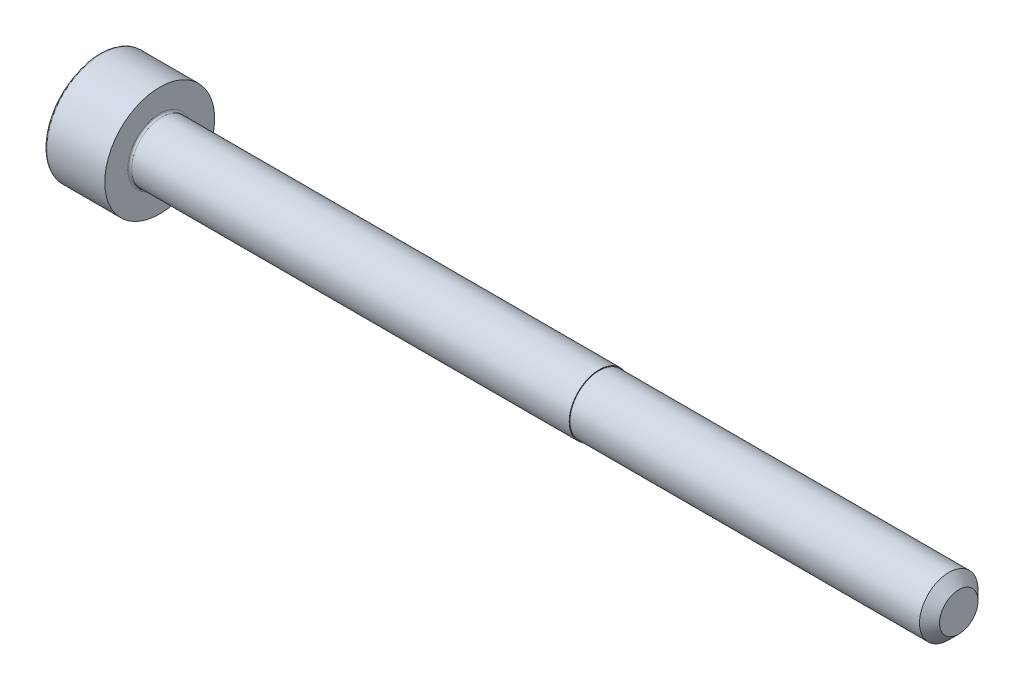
ISO-10303-21;
HEADER;
FILE_DESCRIPTION(('STEP AP214'),'2;1');
FILE_NAME('part.step','',(''),(''),'','','');
FILE_SCHEMA(('AUTOMOTIVE_DESIGN { 1 0 10303 214 1 1 1 1 }'));
ENDSEC;
DATA;
#1=APPLICATION_CONTEXT('core data for automotive mechanical design processes');
#2=APPLICATION_PROTOCOL_DEFINITION('international standard','automotive_design',2000,#1);
#3=PRODUCT_CONTEXT('',#1,'mechanical');
#4=PRODUCT('Part','Part','',(#3));
#5=PRODUCT_RELATED_PRODUCT_CATEGORY('part','',(#4));
#6=PRODUCT_DEFINITION_FORMATION('','',#4);
#7=PRODUCT_DEFINITION_CONTEXT('part definition',#1,'design');
#8=PRODUCT_DEFINITION('design','',#6,#7);
#9=PRODUCT_DEFINITION_SHAPE('','',#8);
#10=(LENGTH_UNIT() NAMED_UNIT(*) SI_UNIT(.MILLI.,.METRE.));
#11=(NAMED_UNIT(*) PLANE_ANGLE_UNIT() SI_UNIT($,.RADIAN.));
#12=(NAMED_UNIT(*) SI_UNIT($,.STERADIAN.) SOLID_ANGLE_UNIT());
#13=UNCERTAINTY_MEASURE_WITH_UNIT(LENGTH_MEASURE(1.E-05),#10,'distance_accuracy_value','');
#14=(GEOMETRIC_REPRESENTATION_CONTEXT(3) GLOBAL_UNCERTAINTY_ASSIGNED_CONTEXT((#13)) GLOBAL_UNIT_ASSIGNED_CONTEXT((#10,
#11,#12)) REPRESENTATION_CONTEXT('',''));
#15=CARTESIAN_POINT('',(0.,0.,0.));
#16=DIRECTION('',(0.,0.,1.));
#17=DIRECTION('',(1.,0.,0.));
#18=AXIS2_PLACEMENT_3D('',#15,#16,#17);
#19=CARTESIAN_POINT('',(-64.4999999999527,-15.5,-15.5));
#20=DIRECTION('',(-1.,0.,0.));
#21=DIRECTION('',(0.,0.,1.));
#22=AXIS2_PLACEMENT_3D('',#19,#20,#21);
#23=CONICAL_SURFACE('',#22,1.43649999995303,1.04719755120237);
#24=CARTESIAN_POINT('',(-63.672046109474,-15.5000000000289,-15.4999999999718));
#25=VERTEX_POINT('',#24);
#26=VERTEX_LOOP('',#25);
#27=FACE_BOUND('',#26,.T.);
#28=CARTESIAN_POINT('',(-64.4999999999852,-15.4880042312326,-16.936449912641));
#29=CARTESIAN_POINT('',(-64.4841458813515,-15.4397469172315,-16.9085885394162));
#30=CARTESIAN_POINT('',(-64.469593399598,-15.3911340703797,-16.8805218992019));
#31=CARTESIAN_POINT('',(-64.4437170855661,-15.2931739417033,-16.8239645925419));
#32=CARTESIAN_POINT('',(-64.4323995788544,-15.2438254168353,-16.7954732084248));
#33=CARTESIAN_POINT('',(-64.4138876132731,-15.1456319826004,-16.7387812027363));
#34=CARTESIAN_POINT('',(-64.4066092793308,-15.0967992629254,-16.7105876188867));
#35=CARTESIAN_POINT('',(-64.3963161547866,-14.9988374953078,-16.6540293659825));
#36=CARTESIAN_POINT('',(-64.3932974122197,-14.9497087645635,-16.6256648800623));
#37=CARTESIAN_POINT('',(-64.3916876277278,-14.8472360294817,-16.5665022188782));
#38=CARTESIAN_POINT('',(-64.3934926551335,-14.7938869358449,-16.5357011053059));
#39=CARTESIAN_POINT('',(-64.4022257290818,-14.6874539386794,-16.4742519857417));
#40=CARTESIAN_POINT('',(-64.4091594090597,-14.6343703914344,-16.4436041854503));
#41=CARTESIAN_POINT('',(-64.4277856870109,-14.5275542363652,-16.3819338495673));
#42=CARTESIAN_POINT('',(-64.439588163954,-14.4738364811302,-16.350919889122));
#43=CARTESIAN_POINT('',(-64.4670866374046,-14.3672693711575,-16.2893933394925));
#44=CARTESIAN_POINT('',(-64.4827740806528,-14.3144183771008,-16.2588798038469));
#45=CARTESIAN_POINT('',(-64.4999999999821,-14.2619957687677,-16.2286135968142));
#46=B_SPLINE_CURVE_WITH_KNOTS('',3,(#28,#29,#30,#31,#32,#33,#34,#35,#36,#37,#38,#39,#40,#41,#42,
#43,#44,#45),.UNSPECIFIED.,.F.,.F.,(4,2,2,2,2,2,2,2,4),(0.,0.173845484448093,0.348028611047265,
0.518444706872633,0.688702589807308,0.873360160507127,1.05822086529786,1.24750397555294,
1.43637400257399),.UNSPECIFIED.);
#47=CARTESIAN_POINT('',(-64.4999999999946,-15.4880042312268,-16.9364499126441));
#48=VERTEX_POINT('',#47);
#49=CARTESIAN_POINT('',(-64.499999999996,-14.2619957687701,-16.2286135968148));
#50=VERTEX_POINT('',#49);
#51=EDGE_CURVE('E203',#48,#50,#46,.T.);
#52=ORIENTED_EDGE('',*,*,#51,.F.);
#53=CARTESIAN_POINT('',(-64.5000000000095,-15.5,-15.5));
#54=DIRECTION('',(-1.,0.,0.));
#55=DIRECTION('',(0.,0.479425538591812,-0.877582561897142));
#56=AXIS2_PLACEMENT_3D('',#53,#54,#55);
#57=CIRCLE('',#56,1.43650000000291);
#58=CARTESIAN_POINT('',(-64.4999999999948,-15.51199576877,-16.9364499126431));
#59=VERTEX_POINT('',#58);
#60=EDGE_CURVE('E150',#59,#48,#57,.F.);
#61=ORIENTED_EDGE('',*,*,#60,.F.);
#62=CARTESIAN_POINT('',(-64.4999999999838,-16.7380042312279,-16.2286135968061));
#63=CARTESIAN_POINT('',(-64.4820135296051,-16.6832751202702,-16.260211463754));
#64=CARTESIAN_POINT('',(-64.4657060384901,-16.6280732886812,-16.2920822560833));
#65=CARTESIAN_POINT('',(-64.4373567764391,-16.5167305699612,-16.3563660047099));
#66=CARTESIAN_POINT('',(-64.4253248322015,-16.4605878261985,-16.3887800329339));
#67=CARTESIAN_POINT('',(-64.4067534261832,-16.3489922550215,-16.453209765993));
#68=CARTESIAN_POINT('',(-64.4000877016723,-16.2935557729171,-16.4852160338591));
#69=CARTESIAN_POINT('',(-64.3924031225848,-16.1824459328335,-16.5493653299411));
#70=CARTESIAN_POINT('',(-64.3913776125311,-16.1267729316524,-16.5815081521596));
#71=CARTESIAN_POINT('',(-64.3947641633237,-16.0243380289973,-16.6406489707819));
#72=CARTESIAN_POINT('',(-64.3983452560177,-15.9775536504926,-16.6676599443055));
#73=CARTESIAN_POINT('',(-64.4093164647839,-15.8842867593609,-16.7215076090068));
#74=CARTESIAN_POINT('',(-64.4167097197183,-15.8378045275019,-16.7483441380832));
#75=CARTESIAN_POINT('',(-64.4350428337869,-15.7443726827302,-16.802287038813));
#76=CARTESIAN_POINT('',(-64.4460541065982,-15.6974338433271,-16.8293871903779));
#77=CARTESIAN_POINT('',(-64.4709871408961,-15.6042229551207,-16.8832025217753));
#78=CARTESIAN_POINT('',(-64.4849037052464,-15.5579498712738,-16.9099182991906));
#79=CARTESIAN_POINT('',(-64.4999999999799,-15.5119957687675,-16.936449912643));
#80=B_SPLINE_CURVE_WITH_KNOTS('',3,(#62,#63,#64,#65,#66,#67,#68,#69,#70,#71,#72,#73,#74,#75,#76,
#77,#78,#79),.UNSPECIFIED.,.F.,.F.,(4,2,2,2,2,2,2,2,4),(0.,0.197193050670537,0.394836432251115,
0.587681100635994,0.78029816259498,0.94257842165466,1.10499251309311,1.27082710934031,
1.43636755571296),.UNSPECIFIED.);
#81=CARTESIAN_POINT('',(-64.4999999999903,-16.7380042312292,-16.2286135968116));
#82=VERTEX_POINT('',#81);
#83=EDGE_CURVE('E212',#82,#59,#80,.T.);
#84=ORIENTED_EDGE('',*,*,#83,.F.);
#85=CARTESIAN_POINT('',(-64.5,-15.5,-15.5));
#86=DIRECTION('',(1.,0.,0.));
#87=DIRECTION('',(0.,0.,-1.));
#88=AXIS2_PLACEMENT_3D('',#85,#86,#87);
#89=CIRCLE('',#88,1.4365);
#90=CARTESIAN_POINT('',(-64.4999999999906,-16.7500000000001,-16.2078363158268));
#91=VERTEX_POINT('',#90);
#92=EDGE_CURVE('E153',#82,#91,#89,.F.);
#93=ORIENTED_EDGE('',*,*,#92,.T.);
#94=CARTESIAN_POINT('',(-64.499999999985,-16.7499999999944,-14.79216368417));
#95=CARTESIAN_POINT('',(-64.4820135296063,-16.749999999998,-14.8553594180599));
#96=CARTESIAN_POINT('',(-64.4657060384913,-16.7499999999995,-14.9191010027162));
#97=CARTESIAN_POINT('',(-64.4373567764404,-16.7500000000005,-15.0476684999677));
#98=CARTESIAN_POINT('',(-64.425324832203,-16.7500000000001,-15.1124965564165));
#99=CARTESIAN_POINT('',(-64.4067534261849,-16.7499999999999,-15.2413560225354));
#100=CARTESIAN_POINT('',(-64.4000877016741,-16.75,-15.3053685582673));
#101=CARTESIAN_POINT('',(-64.3924031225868,-16.75,-15.4336671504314));
#102=CARTESIAN_POINT('',(-64.3913776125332,-16.75,-15.4979527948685));
#103=CARTESIAN_POINT('',(-64.394764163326,-16.75,-15.6162344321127));
#104=CARTESIAN_POINT('',(-64.3983452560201,-16.75,-15.6702563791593));
#105=CARTESIAN_POINT('',(-64.4093164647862,-16.75,-15.7779517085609));
#106=CARTESIAN_POINT('',(-64.4167097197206,-16.75,-15.831624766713));
#107=CARTESIAN_POINT('',(-64.435042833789,-16.75,-15.9395105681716));
#108=CARTESIAN_POINT('',(-64.4460541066,-16.75,-15.9937108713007));
#109=CARTESIAN_POINT('',(-64.4709871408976,-16.75,-16.1013415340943));
#110=CARTESIAN_POINT('',(-64.4849037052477,-16.75,-16.1547730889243));
#111=CARTESIAN_POINT('',(-64.499999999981,-16.75,-16.2078363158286));
#112=B_SPLINE_CURVE_WITH_KNOTS('',3,(#94,#95,#96,#97,#98,#99,#100,#101,#102,#103,#104,#105,#106,
#107,#108,#109,#110,#111),.UNSPECIFIED.,.F.,.F.,(4,2,2,2,2,2,2,2,4),(0.,0.197193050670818,
0.394836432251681,0.587681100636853,0.780298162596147,0.942578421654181,1.10499251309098,
1.27082710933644,1.43636755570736),.UNSPECIFIED.);
#113=CARTESIAN_POINT('',(-64.4999999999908,-16.75,-14.7921636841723));
#114=VERTEX_POINT('',#113);
#115=EDGE_CURVE('E156',#114,#91,#112,.T.);
#116=ORIENTED_EDGE('',*,*,#115,.F.);
#117=CARTESIAN_POINT('',(-64.5,-15.5,-15.5));
#118=DIRECTION('',(1.,0.,0.));
#119=DIRECTION('',(0.,0.,-1.));
#120=AXIS2_PLACEMENT_3D('',#117,#118,#119);
#121=CIRCLE('',#120,1.4365);
#122=CARTESIAN_POINT('',(-64.4999999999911,-16.7380042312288,-14.7713864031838));
#123=VERTEX_POINT('',#122);
#124=EDGE_CURVE('E157',#114,#123,#121,.F.);
#125=ORIENTED_EDGE('',*,*,#124,.T.);
#126=CARTESIAN_POINT('',(-64.4999999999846,-15.5119957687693,-14.0635500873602));
#127=CARTESIAN_POINT('',(-64.4841458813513,-15.5602530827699,-14.0914114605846));
#128=CARTESIAN_POINT('',(-64.4695933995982,-15.6088659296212,-14.1194781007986));
#129=CARTESIAN_POINT('',(-64.443717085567,-15.7068260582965,-14.176035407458));
#130=CARTESIAN_POINT('',(-64.4323995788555,-15.7561745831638,-14.2045267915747));
#131=CARTESIAN_POINT('',(-64.4138876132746,-15.8543680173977,-14.2612187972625));
#132=CARTESIAN_POINT('',(-64.4066092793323,-15.9032007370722,-14.2894123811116));
#133=CARTESIAN_POINT('',(-64.3963161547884,-16.0011625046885,-14.3459706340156));
#134=CARTESIAN_POINT('',(-64.3932974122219,-16.050291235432,-14.374335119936));
#135=CARTESIAN_POINT('',(-64.3916876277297,-16.1527639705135,-14.4334977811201));
#136=CARTESIAN_POINT('',(-64.3934926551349,-16.206113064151,-14.4642988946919));
#137=CARTESIAN_POINT('',(-64.4022257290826,-16.3125460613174,-14.5257480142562));
#138=CARTESIAN_POINT('',(-64.4091594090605,-16.3656296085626,-14.5563958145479));
#139=CARTESIAN_POINT('',(-64.4277856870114,-16.4724457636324,-14.6180661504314));
#140=CARTESIAN_POINT('',(-64.4395881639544,-16.5261635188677,-14.6490801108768));
#141=CARTESIAN_POINT('',(-64.4670866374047,-16.632730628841,-14.7106066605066));
#142=CARTESIAN_POINT('',(-64.4827740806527,-16.6855816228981,-14.7411201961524));
#143=CARTESIAN_POINT('',(-64.4999999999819,-16.7380042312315,-14.7713864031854));
#144=B_SPLINE_CURVE_WITH_KNOTS('',3,(#126,#127,#128,#129,#130,#131,#132,#133,#134,#135,#136,
#137,#138,#139,#140,#141,#142,#143),.UNSPECIFIED.,.F.,.F.,(4,2,2,2,2,2,2,2,4),(0.,
0.173845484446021,0.34802861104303,0.518444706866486,0.688702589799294,0.873360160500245,
1.05822086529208,1.2475039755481,1.43637400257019),.UNSPECIFIED.);
#145=CARTESIAN_POINT('',(-64.4999999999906,-15.5119957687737,-14.0635500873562));
#146=VERTEX_POINT('',#145);
#147=EDGE_CURVE('E160',#146,#123,#144,.T.);
#148=ORIENTED_EDGE('',*,*,#147,.F.);
#149=CARTESIAN_POINT('',(-64.5,-15.5,-15.5));
#150=DIRECTION('',(1.,0.,0.));
#151=DIRECTION('',(0.,0.,-1.));
#152=AXIS2_PLACEMENT_3D('',#149,#150,#151);
#153=CIRCLE('',#152,1.4365);
#154=CARTESIAN_POINT('',(-64.4999999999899,-15.4880042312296,-14.0635500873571));
#155=VERTEX_POINT('',#154);
#156=EDGE_CURVE('E161',#146,#155,#153,.F.);
#157=ORIENTED_EDGE('',*,*,#156,.T.);
#158=CARTESIAN_POINT('',(-64.4999999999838,-14.2619957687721,-14.7713864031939));
#159=CARTESIAN_POINT('',(-64.4820135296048,-14.3167248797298,-14.739788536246));
#160=CARTESIAN_POINT('',(-64.4657060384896,-14.3719267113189,-14.7079177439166));
#161=CARTESIAN_POINT('',(-64.4373567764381,-14.4832694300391,-14.6436339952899));
#162=CARTESIAN_POINT('',(-64.4253248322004,-14.539412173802,-14.6112199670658));
#163=CARTESIAN_POINT('',(-64.4067534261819,-14.6510077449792,-14.5467902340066));
#164=CARTESIAN_POINT('',(-64.4000877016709,-14.7064442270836,-14.5147839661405));
#165=CARTESIAN_POINT('',(-64.3924031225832,-14.8175540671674,-14.4506346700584));
#166=CARTESIAN_POINT('',(-64.3913776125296,-14.8732270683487,-14.4184918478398));
#167=CARTESIAN_POINT('',(-64.3947641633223,-14.9756619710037,-14.3593510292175));
#168=CARTESIAN_POINT('',(-64.3983452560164,-15.0224463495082,-14.332340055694));
#169=CARTESIAN_POINT('',(-64.4093164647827,-15.1157132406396,-14.2784923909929));
#170=CARTESIAN_POINT('',(-64.4167097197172,-15.1621954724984,-14.2516558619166));
#171=CARTESIAN_POINT('',(-64.4350428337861,-15.2556273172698,-14.1977129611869));
#172=CARTESIAN_POINT('',(-64.4460541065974,-15.3025661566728,-14.1706128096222));
#173=CARTESIAN_POINT('',(-64.4709871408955,-15.3957770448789,-14.116797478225));
#174=CARTESIAN_POINT('',(-64.484903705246,-15.4420501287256,-14.0900817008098));
#175=CARTESIAN_POINT('',(-64.4999999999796,-15.4880042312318,-14.0635500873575));
#176=B_SPLINE_CURVE_WITH_KNOTS('',3,(#158,#159,#160,#161,#162,#163,#164,#165,#166,#167,#168,
#169,#170,#171,#172,#173,#174,#175),.UNSPECIFIED.,.F.,.F.,(4,2,2,2,2,2,2,2,4),(0.,
0.197193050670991,0.394836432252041,0.587681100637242,0.780298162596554,0.942578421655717,
1.10499251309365,1.27082710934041,1.43636755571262),.UNSPECIFIED.);
#177=CARTESIAN_POINT('',(-64.4999999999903,-14.2619957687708,-14.7713864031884));
#178=VERTEX_POINT('',#177);
#179=EDGE_CURVE('E127',#178,#155,#176,.T.);
#180=ORIENTED_EDGE('',*,*,#179,.F.);
#181=CARTESIAN_POINT('',(-64.5,-15.5,-15.5));
#182=DIRECTION('',(1.,0.,0.));
#183=DIRECTION('',(0.,0.,-1.));
#184=AXIS2_PLACEMENT_3D('',#181,#182,#183);
#185=CIRCLE('',#184,1.4365);
#186=CARTESIAN_POINT('',(-64.4999999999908,-14.25,-14.7921636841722));
#187=VERTEX_POINT('',#186);
#188=EDGE_CURVE('E121',#178,#187,#185,.F.);
#189=ORIENTED_EDGE('',*,*,#188,.T.);
#190=CARTESIAN_POINT('',(-64.4999999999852,-14.2500000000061,-16.2078363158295));
#191=CARTESIAN_POINT('',(-64.482013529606,-14.2500000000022,-16.1446405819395));
#192=CARTESIAN_POINT('',(-64.4657060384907,-14.2500000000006,-16.0808989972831));
#193=CARTESIAN_POINT('',(-64.4373567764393,-14.2499999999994,-15.9523315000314));
#194=CARTESIAN_POINT('',(-64.4253248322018,-14.2499999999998,-15.8875034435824));
#195=CARTESIAN_POINT('',(-64.4067534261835,-14.2500000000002,-15.7586439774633));
#196=CARTESIAN_POINT('',(-64.4000877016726,-14.25,-15.6946314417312));
#197=CARTESIAN_POINT('',(-64.3924031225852,-14.25,-15.5663328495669));
#198=CARTESIAN_POINT('',(-64.3913776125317,-14.25,-15.5020472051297));
#199=CARTESIAN_POINT('',(-64.3947641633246,-14.25,-15.3837655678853));
#200=CARTESIAN_POINT('',(-64.3983452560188,-14.25,-15.3297436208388));
#201=CARTESIAN_POINT('',(-64.4093164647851,-14.25,-15.2220482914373));
#202=CARTESIAN_POINT('',(-64.4167097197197,-14.25,-15.1683752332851));
#203=CARTESIAN_POINT('',(-64.4350428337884,-14.25,-15.0604894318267));
#204=CARTESIAN_POINT('',(-64.4460541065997,-14.25,-15.0062891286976));
#205=CARTESIAN_POINT('',(-64.4709871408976,-14.25,-14.898658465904));
#206=CARTESIAN_POINT('',(-64.4849037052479,-14.25,-14.845226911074));
#207=CARTESIAN_POINT('',(-64.4999999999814,-14.25,-14.7921636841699));
#208=B_SPLINE_CURVE_WITH_KNOTS('',3,(#190,#191,#192,#193,#194,#195,#196,#197,#198,#199,#200,
#201,#202,#203,#204,#205,#206,#207),.UNSPECIFIED.,.F.,.F.,(4,2,2,2,2,2,2,2,4),(0.,
0.197193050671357,0.394836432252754,0.587681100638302,0.780298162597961,0.942578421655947,
1.10499251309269,1.27082710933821,1.43636755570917),.UNSPECIFIED.);
#209=CARTESIAN_POINT('',(-64.4999999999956,-14.2500000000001,-16.2078363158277));
#210=VERTEX_POINT('',#209);
#211=EDGE_CURVE('E124',#210,#187,#208,.T.);
#212=ORIENTED_EDGE('',*,*,#211,.F.);
#213=CARTESIAN_POINT('',(-64.5000000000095,-15.5,-15.5));
#214=DIRECTION('',(-1.,0.,0.));
#215=DIRECTION('',(0.,0.479425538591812,-0.877582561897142));
#216=AXIS2_PLACEMENT_3D('',#213,#214,#215);
#217=CIRCLE('',#216,1.43650000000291);
#218=EDGE_CURVE('E138',#50,#210,#217,.F.);
#219=ORIENTED_EDGE('',*,*,#218,.F.);
#220=EDGE_LOOP('',(#52,#61,#84,#93,#116,#125,#148,#157,#180,#189,#212,#219));
#221=FACE_BOUND('',#220,.T.);
#222=ADVANCED_FACE('F17',(#27,#221),#23,.F.);
#223=CARTESIAN_POINT('',(-65.8,-14.25,-14.778312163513));
#224=DIRECTION('',(0.,-1.,0.));
#225=DIRECTION('',(0.,0.,-1.));
#226=AXIS2_PLACEMENT_3D('',#223,#224,#225);
#227=PLANE('',#226);
#228=ORIENTED_EDGE('',*,*,#211,.T.);
#229=DIRECTION('',(1.,0.,0.));
#230=VECTOR('',#229,1.);
#231=CARTESIAN_POINT('',(-64.73531816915,-14.2500000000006,-14.7921636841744));
#232=LINE('',#231,#230);
#233=CARTESIAN_POINT('',(-65.8,-14.2500000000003,-14.7921636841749));
#234=VERTEX_POINT('',#233);
#235=EDGE_CURVE('E131',#187,#234,#232,.F.);
#236=ORIENTED_EDGE('',*,*,#235,.T.);
#237=DIRECTION('',(0.,0.,1.));
#238=VECTOR('',#237,1.);
#239=CARTESIAN_POINT('',(-65.8,-14.25,-15.5));
#240=LINE('',#239,#238);
#241=CARTESIAN_POINT('',(-65.8,-14.2500000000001,-16.2078363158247));
#242=VERTEX_POINT('',#241);
#243=EDGE_CURVE('E202',#242,#234,#240,.T.);
#244=ORIENTED_EDGE('',*,*,#243,.F.);
#245=DIRECTION('',(1.,0.,0.));
#246=VECTOR('',#245,1.);
#247=CARTESIAN_POINT('',(-64.73531816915,-14.2500000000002,-16.2078363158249));
#248=LINE('',#247,#246);
#249=EDGE_CURVE('E137',#242,#210,#248,.T.);
#250=ORIENTED_EDGE('',*,*,#249,.T.);
#251=EDGE_LOOP('',(#228,#236,#244,#250));
#252=FACE_BOUND('',#251,.T.);
#253=ADVANCED_FACE('F134',(#252),#227,.T.);
#254=CARTESIAN_POINT('',(-64.73531816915,-15.5,-15.5));
#255=DIRECTION('',(1.,0.,0.));
#256=DIRECTION('',(0.,0.,-1.));
#257=AXIS2_PLACEMENT_3D('',#254,#255,#256);
#258=CYLINDRICAL_SURFACE('',#257,1.4365);
#259=ORIENTED_EDGE('',*,*,#235,.F.);
#260=ORIENTED_EDGE('',*,*,#188,.F.);
#261=DIRECTION('',(1.,0.,0.));
#262=VECTOR('',#261,1.);
#263=CARTESIAN_POINT('',(-65.8,-14.261995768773,-14.7713864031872));
#264=LINE('',#263,#262);
#265=CARTESIAN_POINT('',(-65.8,-14.261995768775,-14.7713864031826));
#266=VERTEX_POINT('',#265);
#267=EDGE_CURVE('E144',#266,#178,#264,.T.);
#268=ORIENTED_EDGE('',*,*,#267,.F.);
#269=CARTESIAN_POINT('',(-65.8,-15.5,-15.5));
#270=DIRECTION('',(-1.,0.,0.));
#271=DIRECTION('',(0.,0.,1.));
#272=AXIS2_PLACEMENT_3D('',#269,#270,#271);
#273=CIRCLE('',#272,1.4365);
#274=EDGE_CURVE('E142',#234,#266,#273,.F.);
#275=ORIENTED_EDGE('',*,*,#274,.F.);
#276=EDGE_LOOP('',(#259,#260,#268,#275));
#277=FACE_BOUND('',#276,.T.);
#278=ADVANCED_FACE('F140',(#277),#258,.F.);
#279=CARTESIAN_POINT('',(-65.8,-15.5,-14.05662432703));
#280=DIRECTION('',(0.,-0.50000000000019,-0.866025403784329));
#281=DIRECTION('',(0.,0.866025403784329,-0.50000000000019));
#282=AXIS2_PLACEMENT_3D('',#279,#280,#281);
#283=PLANE('',#282);
#284=ORIENTED_EDGE('',*,*,#179,.T.);
#285=DIRECTION('',(1.,0.,0.));
#286=VECTOR('',#285,1.);
#287=CARTESIAN_POINT('',(-64.73531816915,-15.4880042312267,-14.0635500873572));
#288=LINE('',#287,#286);
#289=CARTESIAN_POINT('',(-65.8,-15.4880042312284,-14.0635500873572));
#290=VERTEX_POINT('',#289);
#291=EDGE_CURVE('E163',#155,#290,#288,.F.);
#292=ORIENTED_EDGE('',*,*,#291,.T.);
#293=DIRECTION('',(0.,-0.866025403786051,0.499999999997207));
#294=VECTOR('',#293,1.);
#295=CARTESIAN_POINT('',(-65.8,-14.26199576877,-14.771386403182));
#296=LINE('',#295,#294);
#297=EDGE_CURVE('E200',#266,#290,#296,.T.);
#298=ORIENTED_EDGE('',*,*,#297,.F.);
#299=ORIENTED_EDGE('',*,*,#267,.T.);
#300=EDGE_LOOP('',(#284,#292,#298,#299));
#301=FACE_BOUND('',#300,.T.);
#302=ADVANCED_FACE('F357',(#301),#283,.T.);
#303=CARTESIAN_POINT('',(-64.73531816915,-15.5,-15.5));
#304=DIRECTION('',(1.,0.,0.));
#305=DIRECTION('',(0.,0.,-1.));
#306=AXIS2_PLACEMENT_3D('',#303,#304,#305);
#307=CYLINDRICAL_SURFACE('',#306,1.4365);
#308=DIRECTION('',(1.,0.,0.));
#309=VECTOR('',#308,1.);
#310=CARTESIAN_POINT('',(-65.8,-15.5119957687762,-14.0635500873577));
#311=LINE('',#310,#309);
#312=CARTESIAN_POINT('',(-65.8,-15.511995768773,-14.0635500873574));
#313=VERTEX_POINT('',#312);
#314=EDGE_CURVE('E162',#313,#146,#311,.T.);
#315=ORIENTED_EDGE('',*,*,#314,.F.);
#316=CARTESIAN_POINT('',(-65.8,-15.5,-15.5));
#317=DIRECTION('',(-1.,0.,0.));
#318=DIRECTION('',(0.,0.,1.));
#319=AXIS2_PLACEMENT_3D('',#316,#317,#318);
#320=CIRCLE('',#319,1.4365);
#321=EDGE_CURVE('E197',#290,#313,#320,.F.);
#322=ORIENTED_EDGE('',*,*,#321,.F.);
#323=ORIENTED_EDGE('',*,*,#291,.F.);
#324=ORIENTED_EDGE('',*,*,#156,.F.);
#325=EDGE_LOOP('',(#315,#322,#323,#324));
#326=FACE_BOUND('',#325,.T.);
#327=ADVANCED_FACE('F361',(#326),#307,.F.);
#328=CARTESIAN_POINT('',(-65.8,-16.75,-14.778312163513));
#329=DIRECTION('',(0.,0.50000000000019,-0.866025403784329));
#330=DIRECTION('',(0.,0.866025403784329,0.50000000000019));
#331=AXIS2_PLACEMENT_3D('',#328,#329,#330);
#332=PLANE('',#331);
#333=ORIENTED_EDGE('',*,*,#147,.T.);
#334=DIRECTION('',(1.,0.,0.));
#335=VECTOR('',#334,1.);
#336=CARTESIAN_POINT('',(-64.73531816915,-16.7380042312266,-14.771386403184));
#337=LINE('',#336,#335);
#338=CARTESIAN_POINT('',(-65.8,-16.7380042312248,-14.771386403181));
#339=VERTEX_POINT('',#338);
#340=EDGE_CURVE('E159',#123,#339,#337,.F.);
#341=ORIENTED_EDGE('',*,*,#340,.T.);
#342=DIRECTION('',(0.,-0.866025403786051,-0.499999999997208));
#343=VECTOR('',#342,1.);
#344=CARTESIAN_POINT('',(-65.8,-15.5119957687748,-14.06355008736));
#345=LINE('',#344,#343);
#346=EDGE_CURVE('E196',#313,#339,#345,.T.);
#347=ORIENTED_EDGE('',*,*,#346,.F.);
#348=ORIENTED_EDGE('',*,*,#314,.T.);
#349=EDGE_LOOP('',(#333,#341,#347,#348));
#350=FACE_BOUND('',#349,.T.);
#351=ADVANCED_FACE('F406',(#350),#332,.T.);
#352=CARTESIAN_POINT('',(-64.73531816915,-15.5,-15.5));
#353=DIRECTION('',(1.,0.,0.));
#354=DIRECTION('',(0.,0.,-1.));
#355=AXIS2_PLACEMENT_3D('',#352,#353,#354);
#356=CYLINDRICAL_SURFACE('',#355,1.4365);
#357=ORIENTED_EDGE('',*,*,#124,.F.);
#358=DIRECTION('',(1.,0.,0.));
#359=VECTOR('',#358,1.);
#360=CARTESIAN_POINT('',(-65.8,-16.75,-14.792163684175));
#361=LINE('',#360,#359);
#362=CARTESIAN_POINT('',(-65.8,-16.75,-14.7921636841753));
#363=VERTEX_POINT('',#362);
#364=EDGE_CURVE('E344',#363,#114,#361,.T.);
#365=ORIENTED_EDGE('',*,*,#364,.F.);
#366=CARTESIAN_POINT('',(-65.8,-15.5,-15.5));
#367=DIRECTION('',(-1.,0.,0.));
#368=DIRECTION('',(0.,0.,1.));
#369=AXIS2_PLACEMENT_3D('',#366,#367,#368);
#370=CIRCLE('',#369,1.4365);
#371=EDGE_CURVE('E193',#339,#363,#370,.F.);
#372=ORIENTED_EDGE('',*,*,#371,.F.);
#373=ORIENTED_EDGE('',*,*,#340,.F.);
#374=EDGE_LOOP('',(#357,#365,#372,#373));
#375=FACE_BOUND('',#374,.T.);
#376=ADVANCED_FACE('F404',(#375),#356,.F.);
#377=CARTESIAN_POINT('',(-65.8,-16.75,-16.221687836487));
#378=DIRECTION('',(0.,1.,0.));
#379=DIRECTION('',(0.,0.,1.));
#380=AXIS2_PLACEMENT_3D('',#377,#378,#379);
#381=PLANE('',#380);
#382=ORIENTED_EDGE('',*,*,#115,.T.);
#383=DIRECTION('',(1.,0.,0.));
#384=VECTOR('',#383,1.);
#385=CARTESIAN_POINT('',(-64.73531816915,-16.7500000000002,-16.2078363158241));
#386=LINE('',#385,#384);
#387=CARTESIAN_POINT('',(-65.8,-16.7500000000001,-16.2078363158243));
#388=VERTEX_POINT('',#387);
#389=EDGE_CURVE('E155',#91,#388,#386,.F.);
#390=ORIENTED_EDGE('',*,*,#389,.T.);
#391=DIRECTION('',(0.,0.,1.));
#392=VECTOR('',#391,1.);
#393=CARTESIAN_POINT('',(-65.8,-16.75,-15.5));
#394=LINE('',#393,#392);
#395=EDGE_CURVE('E192',#363,#388,#394,.F.);
#396=ORIENTED_EDGE('',*,*,#395,.F.);
#397=ORIENTED_EDGE('',*,*,#364,.T.);
#398=EDGE_LOOP('',(#382,#390,#396,#397));
#399=FACE_BOUND('',#398,.T.);
#400=ADVANCED_FACE('F388',(#399),#381,.T.);
#401=CARTESIAN_POINT('',(-64.73531816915,-15.5,-15.5));
#402=DIRECTION('',(1.,0.,0.));
#403=DIRECTION('',(0.,0.,-1.));
#404=AXIS2_PLACEMENT_3D('',#401,#402,#403);
#405=CYLINDRICAL_SURFACE('',#404,1.4365);
#406=ORIENTED_EDGE('',*,*,#389,.F.);
#407=ORIENTED_EDGE('',*,*,#92,.F.);
#408=DIRECTION('',(1.,0.,0.));
#409=VECTOR('',#408,1.);
#410=CARTESIAN_POINT('',(-65.8,-16.738004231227,-16.2286135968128));
#411=LINE('',#410,#409);
#412=CARTESIAN_POINT('',(-65.8,-16.738004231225,-16.2286135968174));
#413=VERTEX_POINT('',#412);
#414=EDGE_CURVE('E338',#413,#82,#411,.T.);
#415=ORIENTED_EDGE('',*,*,#414,.F.);
#416=CARTESIAN_POINT('',(-65.8,-15.5,-15.5));
#417=DIRECTION('',(-1.,0.,0.));
#418=DIRECTION('',(0.,0.,1.));
#419=AXIS2_PLACEMENT_3D('',#416,#417,#418);
#420=CIRCLE('',#419,1.4365);
#421=EDGE_CURVE('E189',#388,#413,#420,.F.);
#422=ORIENTED_EDGE('',*,*,#421,.F.);
#423=EDGE_LOOP('',(#406,#407,#415,#422));
#424=FACE_BOUND('',#423,.T.);
#425=ADVANCED_FACE('F384',(#424),#405,.F.);
#426=CARTESIAN_POINT('',(-65.8,-15.5,-16.94337567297));
#427=DIRECTION('',(0.,0.50000000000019,0.866025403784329));
#428=DIRECTION('',(0.,-0.866025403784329,0.50000000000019));
#429=AXIS2_PLACEMENT_3D('',#426,#427,#428);
#430=PLANE('',#429);
#431=ORIENTED_EDGE('',*,*,#83,.T.);
#432=DIRECTION('',(1.,0.,0.));
#433=VECTOR('',#432,1.);
#434=CARTESIAN_POINT('',(-64.73531816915,-15.5119957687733,-16.9364499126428));
#435=LINE('',#434,#433);
#436=CARTESIAN_POINT('',(-65.8,-15.5119957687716,-16.9364499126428));
#437=VERTEX_POINT('',#436);
#438=EDGE_CURVE('E334',#59,#437,#435,.F.);
#439=ORIENTED_EDGE('',*,*,#438,.T.);
#440=DIRECTION('',(0.,0.86602540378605,-0.499999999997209));
#441=VECTOR('',#440,1.);
#442=CARTESIAN_POINT('',(-65.8,-16.73800423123,-16.228613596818));
#443=LINE('',#442,#441);
#444=EDGE_CURVE('E188',#413,#437,#443,.T.);
#445=ORIENTED_EDGE('',*,*,#444,.F.);
#446=ORIENTED_EDGE('',*,*,#414,.T.);
#447=EDGE_LOOP('',(#431,#439,#445,#446));
#448=FACE_BOUND('',#447,.T.);
#449=ADVANCED_FACE('F379',(#448),#430,.T.);
#450=CARTESIAN_POINT('',(-64.73531816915,-15.5,-15.5));
#451=DIRECTION('',(1.,0.,0.));
#452=DIRECTION('',(0.,0.,-1.));
#453=AXIS2_PLACEMENT_3D('',#450,#451,#452);
#454=CYLINDRICAL_SURFACE('',#453,1.4365);
#455=DIRECTION('',(1.,0.,0.));
#456=VECTOR('',#455,1.);
#457=CARTESIAN_POINT('',(-65.8,-15.4880042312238,-16.9364499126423));
#458=LINE('',#457,#456);
#459=CARTESIAN_POINT('',(-65.8,-15.488004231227,-16.9364499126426));
#460=VERTEX_POINT('',#459);
#461=EDGE_CURVE('E211',#460,#48,#458,.T.);
#462=ORIENTED_EDGE('',*,*,#461,.F.);
#463=CARTESIAN_POINT('',(-65.8,-15.5,-15.5));
#464=DIRECTION('',(-1.,0.,0.));
#465=DIRECTION('',(0.,0.,1.));
#466=AXIS2_PLACEMENT_3D('',#463,#464,#465);
#467=CIRCLE('',#466,1.4365);
#468=EDGE_CURVE('E185',#437,#460,#467,.F.);
#469=ORIENTED_EDGE('',*,*,#468,.F.);
#470=ORIENTED_EDGE('',*,*,#438,.F.);
#471=ORIENTED_EDGE('',*,*,#60,.T.);
#472=EDGE_LOOP('',(#462,#469,#470,#471));
#473=FACE_BOUND('',#472,.T.);
#474=ADVANCED_FACE('F374',(#473),#454,.F.);
#475=CARTESIAN_POINT('',(-65.8,-14.25,-16.221687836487));
#476=DIRECTION('',(0.,-0.50000000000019,0.866025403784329));
#477=DIRECTION('',(0.,-0.866025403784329,-0.50000000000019));
#478=AXIS2_PLACEMENT_3D('',#475,#476,#477);
#479=PLANE('',#478);
#480=ORIENTED_EDGE('',*,*,#51,.T.);
#481=DIRECTION('',(1.,0.,0.));
#482=VECTOR('',#481,1.);
#483=CARTESIAN_POINT('',(-64.73531816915,-14.2619957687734,-16.228613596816));
#484=LINE('',#483,#482);
#485=CARTESIAN_POINT('',(-65.8,-14.2619957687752,-16.228613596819));
#486=VERTEX_POINT('',#485);
#487=EDGE_CURVE('E321',#50,#486,#484,.F.);
#488=ORIENTED_EDGE('',*,*,#487,.T.);
#489=DIRECTION('',(0.,0.86602540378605,0.499999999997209));
#490=VECTOR('',#489,1.);
#491=CARTESIAN_POINT('',(-65.8,-15.4880042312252,-16.93644991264));
#492=LINE('',#491,#490);
#493=EDGE_CURVE('E184',#460,#486,#492,.T.);
#494=ORIENTED_EDGE('',*,*,#493,.F.);
#495=ORIENTED_EDGE('',*,*,#461,.T.);
#496=EDGE_LOOP('',(#480,#488,#494,#495));
#497=FACE_BOUND('',#496,.T.);
#498=ADVANCED_FACE('F219',(#497),#479,.T.);
#499=CARTESIAN_POINT('',(-64.73531816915,-15.5,-15.5));
#500=DIRECTION('',(1.,0.,0.));
#501=DIRECTION('',(0.,0.,-1.));
#502=AXIS2_PLACEMENT_3D('',#499,#500,#501);
#503=CYLINDRICAL_SURFACE('',#502,1.4365);
#504=ORIENTED_EDGE('',*,*,#218,.T.);
#505=ORIENTED_EDGE('',*,*,#249,.F.);
#506=CARTESIAN_POINT('',(-65.8,-15.5,-15.5));
#507=DIRECTION('',(-1.,0.,0.));
#508=DIRECTION('',(0.,0.,1.));
#509=AXIS2_PLACEMENT_3D('',#506,#507,#508);
#510=CIRCLE('',#509,1.4365);
#511=EDGE_CURVE('E180',#486,#242,#510,.F.);
#512=ORIENTED_EDGE('',*,*,#511,.F.);
#513=ORIENTED_EDGE('',*,*,#487,.F.);
#514=EDGE_LOOP('',(#504,#505,#512,#513));
#515=FACE_BOUND('',#514,.T.);
#516=ADVANCED_FACE('F368',(#515),#503,.F.);
#517=CARTESIAN_POINT('',(-65.8,-15.5,-15.5));
#518=DIRECTION('',(-1.,0.,0.));
#519=DIRECTION('',(0.,0.,1.));
#520=AXIS2_PLACEMENT_3D('',#517,#518,#519);
#521=PLANE('',#520);
#522=ORIENTED_EDGE('',*,*,#493,.T.);
#523=ORIENTED_EDGE('',*,*,#511,.T.);
#524=ORIENTED_EDGE('',*,*,#243,.T.);
#525=ORIENTED_EDGE('',*,*,#274,.T.);
#526=ORIENTED_EDGE('',*,*,#297,.T.);
#527=ORIENTED_EDGE('',*,*,#321,.T.);
#528=ORIENTED_EDGE('',*,*,#346,.T.);
#529=ORIENTED_EDGE('',*,*,#371,.T.);
#530=ORIENTED_EDGE('',*,*,#395,.T.);
#531=ORIENTED_EDGE('',*,*,#421,.T.);
#532=ORIENTED_EDGE('',*,*,#444,.T.);
#533=ORIENTED_EDGE('',*,*,#468,.T.);
#534=EDGE_LOOP('',(#522,#523,#524,#525,#526,#527,#528,#529,#530,#531,#532,#533));
#535=FACE_BOUND('',#534,.T.);
#536=CARTESIAN_POINT('',(-65.8,-15.5,-15.5));
#537=DIRECTION('',(1.,0.,0.));
#538=DIRECTION('',(0.,1.,0.));
#539=AXIS2_PLACEMENT_3D('',#536,#537,#538);
#540=CIRCLE('',#539,2.65);
#541=CARTESIAN_POINT('',(-65.8,-12.85,-15.5));
#542=VERTEX_POINT('',#541);
#543=CARTESIAN_POINT('',(-65.8,-18.15,-15.5));
#544=VERTEX_POINT('',#543);
#545=EDGE_CURVE('E179',#542,#544,#540,.T.);
#546=ORIENTED_EDGE('',*,*,#545,.F.);
#547=CARTESIAN_POINT('',(-65.8,-18.15,-15.5));
#548=CARTESIAN_POINT('',(-65.799999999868,-18.150001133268,-15.5457128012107));
#549=CARTESIAN_POINT('',(-65.7999999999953,-18.1488186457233,-15.591425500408));
#550=CARTESIAN_POINT('',(-65.7999999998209,-18.1440945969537,-15.6827282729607));
#551=CARTESIAN_POINT('',(-65.7999999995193,-18.1405530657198,-15.7283183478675));
#552=CARTESIAN_POINT('',(-65.79999999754,-18.1311191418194,-15.8192541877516));
#553=CARTESIAN_POINT('',(-65.7999999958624,-18.1252267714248,-15.8645999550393));
#554=CARTESIAN_POINT('',(-65.7999999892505,-18.1111073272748,-15.9549262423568));
#555=CARTESIAN_POINT('',(-65.7999999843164,-18.1028802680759,-15.9999067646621));
#556=CARTESIAN_POINT('',(-65.7999999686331,-18.0841133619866,-16.0893825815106));
#557=CARTESIAN_POINT('',(-65.7999999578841,-18.0735735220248,-16.133877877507));
#558=CARTESIAN_POINT('',(-65.7999999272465,-18.0502092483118,-16.2222645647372));
#559=CARTESIAN_POINT('',(-65.799999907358,-18.0373848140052,-16.2661559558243));
#560=CARTESIAN_POINT('',(-65.7999998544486,-18.0094855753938,-16.3532177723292));
#561=CARTESIAN_POINT('',(-65.7999998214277,-17.9944107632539,-16.3963881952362));
#562=CARTESIAN_POINT('',(-65.7999997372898,-17.962051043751,-16.4818929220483));
#563=CARTESIAN_POINT('',(-65.7999996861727,-17.9447661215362,-16.5242272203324));
#564=CARTESIAN_POINT('',(-65.7999995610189,-17.9080321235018,-16.6079468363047));
#565=CARTESIAN_POINT('',(-65.799999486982,-17.888583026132,-16.6493321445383));
#566=CARTESIAN_POINT('',(-65.7999993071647,-17.8475731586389,-16.7310432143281));
#567=CARTESIAN_POINT('',(-65.7999992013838,-17.8260123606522,-16.7713689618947));
#568=CARTESIAN_POINT('',(-65.7999989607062,-17.78083427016,-16.8508540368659));
#569=CARTESIAN_POINT('',(-65.7999988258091,-17.7572169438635,-16.8900133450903));
#570=CARTESIAN_POINT('',(-65.7999985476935,-17.7172499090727,-16.9525751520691));
#571=CARTESIAN_POINT('',(-65.7999984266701,-17.7015060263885,-16.976366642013));
#572=CARTESIAN_POINT('',(-65.7999982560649,-17.6751459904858,-17.0148265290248));
#573=CARTESIAN_POINT('',(-65.7999981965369,-17.6647582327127,-17.0296519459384));
#574=CARTESIAN_POINT('',(-65.799998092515,-17.6261989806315,-17.0834647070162));
#575=CARTESIAN_POINT('',(-65.7999982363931,-17.597082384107,-17.1217808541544));
#576=CARTESIAN_POINT('',(-65.7999988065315,-17.5368220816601,-17.1967072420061));
#577=CARTESIAN_POINT('',(-65.7999992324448,-17.5056809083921,-17.2333195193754));
#578=CARTESIAN_POINT('',(-65.7999997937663,-17.4526886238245,-17.2920675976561));
#579=CARTESIAN_POINT('',(-65.7999999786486,-17.4314404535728,-17.3147497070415));
#580=CARTESIAN_POINT('',(-65.7999999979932,-17.4075776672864,-17.3395075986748));
#581=CARTESIAN_POINT('',(-65.7999999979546,-17.4052755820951,-17.3418888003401));
#582=CARTESIAN_POINT('',(-65.7999999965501,-17.3827091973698,-17.3651534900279));
#583=CARTESIAN_POINT('',(-65.7999999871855,-17.3621429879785,-17.3857478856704));
#584=CARTESIAN_POINT('',(-65.7999999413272,-17.3229346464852,-17.4237141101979));
#585=CARTESIAN_POINT('',(-65.7999999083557,-17.3043717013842,-17.4411679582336));
#586=CARTESIAN_POINT('',(-65.799999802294,-17.2613749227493,-17.4804524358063));
#587=CARTESIAN_POINT('',(-65.7999997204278,-17.2367801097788,-17.502107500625));
#588=CARTESIAN_POINT('',(-65.7999995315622,-17.1919106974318,-17.5401594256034));
#589=CARTESIAN_POINT('',(-65.7999994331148,-17.1717800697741,-17.5567266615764));
#590=CARTESIAN_POINT('',(-65.7999991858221,-17.1284751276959,-17.5913096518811));
#591=CARTESIAN_POINT('',(-65.7999990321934,-17.1052366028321,-17.6092453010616));
#592=CARTESIAN_POINT('',(-65.799998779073,-17.0692073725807,-17.6361068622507));
#593=CARTESIAN_POINT('',(-65.7999986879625,-17.0566255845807,-17.6453150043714));
#594=CARTESIAN_POINT('',(-65.7999983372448,-17.0054787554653,-17.6820510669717));
#595=CARTESIAN_POINT('',(-65.7999981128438,-16.9662401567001,-17.7086520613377));
#596=CARTESIAN_POINT('',(-65.7999978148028,-16.8863891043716,-17.7596850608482));
#597=CARTESIAN_POINT('',(-65.7999977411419,-16.8457768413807,-17.7841173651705));
#598=CARTESIAN_POINT('',(-65.7999977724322,-16.7632950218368,-17.830744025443));
#599=CARTESIAN_POINT('',(-65.7999978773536,-16.7214256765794,-17.8529387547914));
#600=CARTESIAN_POINT('',(-65.7999982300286,-16.636555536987,-17.895024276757));
#601=CARTESIAN_POINT('',(-65.7999984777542,-16.5935549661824,-17.914915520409));
#602=CARTESIAN_POINT('',(-65.7999990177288,-16.5065496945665,-17.9523394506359));
#603=CARTESIAN_POINT('',(-65.7999993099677,-16.4625452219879,-17.9698726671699));
#604=CARTESIAN_POINT('',(-65.7999997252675,-16.3861919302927,-17.9979179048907));
#605=CARTESIAN_POINT('',(-65.7999998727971,-16.3540571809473,-18.0090152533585));
#606=CARTESIAN_POINT('',(-65.799999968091,-16.3098368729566,-18.0233432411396));
#607=CARTESIAN_POINT('',(-65.799999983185,-16.2979232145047,-18.0271108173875));
#608=CARTESIAN_POINT('',(-65.8000000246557,-16.2436807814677,-18.043861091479));
#609=CARTESIAN_POINT('',(-65.7999999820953,-16.2010584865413,-18.055910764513));
#610=CARTESIAN_POINT('',(-65.8000000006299,-16.1153264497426,-18.0779230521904));
#611=CARTESIAN_POINT('',(-65.8000000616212,-16.0722172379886,-18.0878877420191));
#612=CARTESIAN_POINT('',(-65.7999998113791,-15.9967955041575,-18.1034300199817));
#613=CARTESIAN_POINT('',(-65.7999995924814,-15.9645791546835,-18.109475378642));
#614=CARTESIAN_POINT('',(-65.7999989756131,-15.9209167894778,-18.1168433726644));
#615=CARTESIAN_POINT('',(-65.7999987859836,-15.9095568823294,-18.1186852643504));
#616=CARTESIAN_POINT('',(-65.7999979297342,-15.8542521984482,-18.1272540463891));
#617=CARTESIAN_POINT('',(-65.7999974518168,-15.8101302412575,-18.1328693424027));
#618=CARTESIAN_POINT('',(-65.7999976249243,-15.7217484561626,-18.141785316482));
#619=CARTESIAN_POINT('',(-65.7999982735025,-15.6774891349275,-18.1450909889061));
#620=CARTESIAN_POINT('',(-65.7999993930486,-15.5993422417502,-18.1486680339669));
#621=CARTESIAN_POINT('',(-65.7999998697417,-15.5654775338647,-18.1494721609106));
#622=CARTESIAN_POINT('',(-65.8000000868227,-15.5087228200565,-18.1500608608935));
#623=CARTESIAN_POINT('',(-65.8000000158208,-15.4858342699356,-18.1500914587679));
#624=CARTESIAN_POINT('',(-65.7999999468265,-15.4410700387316,-18.149527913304));
#625=CARTESIAN_POINT('',(-65.7999999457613,-15.4191940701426,-18.1489611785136));
#626=CARTESIAN_POINT('',(-65.7999999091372,-15.3681963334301,-18.1470194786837));
#627=CARTESIAN_POINT('',(-65.799999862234,-15.3390823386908,-18.1454385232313));
#628=CARTESIAN_POINT('',(-65.7999997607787,-15.2819587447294,-18.1413854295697));
#629=CARTESIAN_POINT('',(-65.7999997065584,-15.2539467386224,-18.1389470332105));
#630=CARTESIAN_POINT('',(-65.7999995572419,-15.1935156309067,-18.1327201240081));
#631=CARTESIAN_POINT('',(-65.7999994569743,-15.1611122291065,-18.128777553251));
#632=CARTESIAN_POINT('',(-65.7999992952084,-15.1048501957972,-18.1208652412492));
#633=CARTESIAN_POINT('',(-65.7999992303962,-15.0809530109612,-18.1171672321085));
#634=CARTESIAN_POINT('',(-65.7999991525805,-15.0319926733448,-18.1088888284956));
#635=CARTESIAN_POINT('',(-65.7999991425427,-15.0069357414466,-18.1042717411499));
#636=CARTESIAN_POINT('',(-65.7999991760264,-14.9379239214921,-18.0905093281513));
#637=CARTESIAN_POINT('',(-65.7999992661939,-14.8941194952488,-18.0805945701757));
#638=CARTESIAN_POINT('',(-65.7999995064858,-14.8127475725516,-18.0599569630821));
#639=CARTESIAN_POINT('',(-65.799999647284,-14.7751100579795,-18.0495070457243));
#640=CARTESIAN_POINT('',(-65.7999998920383,-14.6841211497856,-18.0220680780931));
#641=CARTESIAN_POINT('',(-65.7999999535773,-14.6310293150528,-18.0042078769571));
#642=CARTESIAN_POINT('',(-65.8000000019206,-14.5343858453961,-17.968295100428));
#643=CARTESIAN_POINT('',(-65.7999999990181,-14.4906550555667,-17.9507210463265));
#644=CARTESIAN_POINT('',(-65.7999999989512,-14.4041875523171,-17.9132911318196));
#645=CARTESIAN_POINT('',(-65.8000000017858,-14.3614506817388,-17.8934356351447));
#646=CARTESIAN_POINT('',(-65.7999999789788,-14.2770889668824,-17.8515021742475));
#647=CARTESIAN_POINT('',(-65.7999999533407,-14.235463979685,-17.8294244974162));
#648=CARTESIAN_POINT('',(-65.7999998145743,-14.1534419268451,-17.7831038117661));
#649=CARTESIAN_POINT('',(-65.7999997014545,-14.1130447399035,-17.7588610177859));
#650=CARTESIAN_POINT('',(-65.7999991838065,-14.0391821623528,-17.7118566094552));
#651=CARTESIAN_POINT('',(-65.7999988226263,-14.0055426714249,-17.6893682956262));
#652=CARTESIAN_POINT('',(-65.7999981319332,-13.9499175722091,-17.6502914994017));
#653=CARTESIAN_POINT('',(-65.7999978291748,-13.9276426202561,-17.634113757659));
#654=CARTESIAN_POINT('',(-65.7999974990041,-13.8836565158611,-17.6010578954));
#655=CARTESIAN_POINT('',(-65.7999974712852,-13.8619447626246,-17.5841805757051));
#656=CARTESIAN_POINT('',(-65.7999976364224,-13.8217496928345,-17.5518756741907));
#657=CARTESIAN_POINT('',(-65.7999978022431,-13.8032010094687,-17.5365292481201));
#658=CARTESIAN_POINT('',(-65.7999982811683,-13.7665576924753,-17.5053408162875));
#659=CARTESIAN_POINT('',(-65.7999985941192,-13.7484626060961,-17.4894993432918));
#660=CARTESIAN_POINT('',(-65.7999993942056,-13.6991500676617,-17.4449987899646));
#661=CARTESIAN_POINT('',(-65.7999998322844,-13.6684436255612,-17.4157736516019));
#662=CARTESIAN_POINT('',(-65.8000001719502,-13.6074268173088,-17.3552942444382));
#663=CARTESIAN_POINT('',(-65.800000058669,-13.577149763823,-17.3240064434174));
#664=CARTESIAN_POINT('',(-65.7999999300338,-13.5274767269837,-17.2700565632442));
#665=CARTESIAN_POINT('',(-65.7999998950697,-13.5076585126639,-17.2477833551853));
#666=CARTESIAN_POINT('',(-65.7999997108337,-13.4632417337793,-17.196145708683));
#667=CARTESIAN_POINT('',(-65.7999995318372,-13.4388896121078,-17.1665686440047));
#668=CARTESIAN_POINT('',(-65.7999990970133,-13.3940030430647,-17.1095700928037));
#669=CARTESIAN_POINT('',(-65.7999988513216,-13.3733373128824,-17.0822517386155));
#670=CARTESIAN_POINT('',(-65.7999984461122,-13.3257464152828,-17.0166678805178));
#671=CARTESIAN_POINT('',(-65.7999983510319,-13.2992981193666,-16.97805469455));
#672=CARTESIAN_POINT('',(-65.7999984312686,-13.2477050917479,-16.8982013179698));
#673=CARTESIAN_POINT('',(-65.7999986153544,-13.2226293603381,-16.8569165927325));
#674=CARTESIAN_POINT('',(-65.7999991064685,-13.1741545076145,-16.7718706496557));
#675=CARTESIAN_POINT('',(-65.7999994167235,-13.1508200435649,-16.7280725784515));
#676=CARTESIAN_POINT('',(-65.7999998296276,-13.1054659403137,-16.6368809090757));
#677=CARTESIAN_POINT('',(-65.7999999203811,-13.0835818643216,-16.5894198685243));
#678=CARTESIAN_POINT('',(-65.7999999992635,-13.0448646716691,-16.4986161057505));
#679=CARTESIAN_POINT('',(-65.7999999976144,-13.0277406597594,-16.4553970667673));
#680=CARTESIAN_POINT('',(-65.7999999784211,-12.9972078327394,-16.372149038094));
#681=CARTESIAN_POINT('',(-65.7999999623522,-12.9836021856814,-16.3321921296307));
#682=CARTESIAN_POINT('',(-65.7999998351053,-12.9570356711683,-16.2476460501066));
#683=CARTESIAN_POINT('',(-65.7999997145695,-12.9442756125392,-16.2029934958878));
#684=CARTESIAN_POINT('',(-65.7999995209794,-12.9216699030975,-16.1150922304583));
#685=CARTESIAN_POINT('',(-65.7999994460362,-12.9117191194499,-16.0718705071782));
#686=CARTESIAN_POINT('',(-65.7999993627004,-12.8940164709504,-15.9849808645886));
#687=CARTESIAN_POINT('',(-65.7999993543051,-12.8862645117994,-15.9413129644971));
#688=CARTESIAN_POINT('',(-65.7999994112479,-12.8729823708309,-15.8536435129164));
#689=CARTESIAN_POINT('',(-65.7999994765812,-12.8674520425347,-15.8096419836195));
#690=CARTESIAN_POINT('',(-65.7999996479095,-12.8586265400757,-15.7214193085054));
#691=CARTESIAN_POINT('',(-65.7999997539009,-12.8553311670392,-15.6771981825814));
#692=CARTESIAN_POINT('',(-65.7999999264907,-12.850982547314,-15.5886508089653));
#693=CARTESIAN_POINT('',(-65.7999999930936,-12.8499290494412,-15.544324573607));
#694=CARTESIAN_POINT('',(-65.8,-12.85,-15.5));
#695=B_SPLINE_CURVE_WITH_KNOTS('',3,(#547,#548,#549,#550,#551,#552,#553,#554,#555,#556,#557,
#558,#559,#560,#561,#562,#563,#564,#565,#566,#567,#568,#569,#570,#571,#572,#573,#574,#575,#576,
#577,#578,#579,#580,#581,#582,#583,#584,#585,#586,#587,#588,#589,#590,#591,#592,#593,#594,#595,
#596,#597,#598,#599,#600,#601,#602,#603,#604,#605,#606,#607,#608,#609,#610,#611,#612,#613,#614,
#615,#616,#617,#618,#619,#620,#621,#622,#623,#624,#625,#626,#627,#628,#629,#630,#631,#632,#633,
#634,#635,#636,#637,#638,#639,#640,#641,#642,#643,#644,#645,#646,#647,#648,#649,#650,#651,#652,
#653,#654,#655,#656,#657,#658,#659,#660,#661,#662,#663,#664,#665,#666,#667,#668,#669,#670,#671,
#672,#673,#674,#675,#676,#677,#678,#679,#680,#681,#682,#683,#684,#685,#686,#687,#688,#689,#690,
#691,#692,#693,#694),.UNSPECIFIED.,.F.,.F.,(4,2,2,2,2,2,2,2,2,2,2,2,2,2,2,2,2,2,2,2,2,2,2,2,2,2,
2,2,2,2,2,2,2,2,2,2,2,2,2,2,2,2,2,2,2,2,2,2,2,2,2,2,2,2,2,2,2,2,2,2,2,2,2,2,2,2,2,2,2,2,2,2,2,
4),(0.,0.137122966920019,0.274244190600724,0.411364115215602,0.548483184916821,
0.685601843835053,0.822720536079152,0.959839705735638,1.09695979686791,1.23408125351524,
1.3712045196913,1.50833003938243,1.59390254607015,1.64820700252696,1.79249855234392,
1.93661294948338,2.02983383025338,2.03977005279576,2.12706712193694,2.2034969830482,
2.30178127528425,2.379985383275,2.46803163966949,2.51480457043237,2.65694242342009,
2.79906063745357,2.94115509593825,3.08322168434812,3.22525629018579,3.32722039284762,
3.36470553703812,3.49752569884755,3.6302130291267,3.72852621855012,3.76305051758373,
3.89641657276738,4.02949333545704,4.13109417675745,4.19975526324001,4.26539756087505,
4.35285221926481,4.43719243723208,4.53509574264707,4.60763152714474,4.68405840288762,
4.81872868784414,4.93587909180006,5.10380449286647,5.2451326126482,5.38643823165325,
5.52772559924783,5.66899896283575,5.79034814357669,5.87292448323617,5.95540877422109,
6.02762240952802,6.09976083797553,6.22688595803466,6.35745788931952,6.44688269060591,
6.56178131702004,6.66452037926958,6.80485645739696,6.94969280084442,7.09849254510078,
7.25519166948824,7.39459409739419,7.52117853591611,7.6604317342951,7.79343243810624,
7.92642743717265,8.05941366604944,8.19238805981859,8.32534755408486),.UNSPECIFIED.);
#696=EDGE_CURVE('E183',#544,#542,#695,.T.);
#697=ORIENTED_EDGE('',*,*,#696,.F.);
#698=EDGE_LOOP('',(#546,#697));
#699=FACE_BOUND('',#698,.T.);
#700=ADVANCED_FACE('F364',(#535,#699),#521,.T.);
#701=CARTESIAN_POINT('',(-22.8,-14.03658536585,-15.5));
#702=DIRECTION('',(-1.,0.,0.));
#703=DIRECTION('',(0.,0.,1.));
#704=AXIS2_PLACEMENT_3D('',#701,#702,#703);
#705=PLANE('',#704);
#706=CARTESIAN_POINT('',(-22.8000000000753,-15.4999999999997,-15.5));
#707=DIRECTION('',(-1.,-5.2995219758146E-13,0.));
#708=DIRECTION('',(5.2995219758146E-13,-1.,0.));
#709=AXIS2_PLACEMENT_3D('',#706,#707,#708);
#710=CIRCLE('',#709,0.963414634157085);
#711=CARTESIAN_POINT('',(-22.8000000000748,-16.4634146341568,-15.5));
#712=VERTEX_POINT('',#711);
#713=EDGE_CURVE('E175',#712,#712,#710,.T.);
#714=ORIENTED_EDGE('',*,*,#713,.F.);
#715=EDGE_LOOP('',(#714));
#716=FACE_BOUND('',#715,.T.);
#717=ADVANCED_FACE('F310',(#716),#705,.F.);
#718=CARTESIAN_POINT('',(-65.7,-15.5,-15.5));
#719=DIRECTION('',(-1.,0.,0.));
#720=DIRECTION('',(0.,-0.824491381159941,-0.565874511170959));
#721=AXIS2_PLACEMENT_3D('',#718,#719,#720);
#722=TOROIDAL_SURFACE('',#721,2.65,0.1);
#723=CARTESIAN_POINT('',(-65.7,-15.5,-15.5));
#724=DIRECTION('',(-1.,0.,0.));
#725=DIRECTION('',(0.,0.,1.));
#726=AXIS2_PLACEMENT_3D('',#723,#724,#725);
#727=CIRCLE('',#726,2.75);
#728=CARTESIAN_POINT('',(-65.7,-15.5,-12.75));
#729=VERTEX_POINT('',#728);
#730=EDGE_CURVE('E178',#729,#729,#727,.F.);
#731=ORIENTED_EDGE('',*,*,#730,.F.);
#732=EDGE_LOOP('',(#731));
#733=FACE_BOUND('',#732,.T.);
#734=ORIENTED_EDGE('',*,*,#545,.T.);
#735=ORIENTED_EDGE('',*,*,#696,.T.);
#736=EDGE_LOOP('',(#734,#735));
#737=FACE_BOUND('',#736,.T.);
#738=ADVANCED_FACE('F304',(#733,#737),#722,.T.);
#739=CARTESIAN_POINT('',(-23.3000000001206,-15.5,-15.5));
#740=DIRECTION('',(-1.,-5.2995219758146E-13,0.));
#741=DIRECTION('',(5.2995219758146E-13,-1.,0.));
#742=AXIS2_PLACEMENT_3D('',#739,#740,#741);
#743=CONICAL_SURFACE('',#742,1.46341463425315,0.785398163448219);
#744=ORIENTED_EDGE('',*,*,#713,.T.);
#745=EDGE_LOOP('',(#744));
#746=FACE_BOUND('',#745,.T.);
#747=CARTESIAN_POINT('',(-23.3,-15.5,-15.5));
#748=DIRECTION('',(-1.,0.,0.));
#749=DIRECTION('',(0.,0.,1.));
#750=AXIS2_PLACEMENT_3D('',#747,#748,#749);
#751=CIRCLE('',#750,1.46341463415);
#752=CARTESIAN_POINT('',(-23.3,-15.5,-14.03658536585));
#753=VERTEX_POINT('',#752);
#754=EDGE_CURVE('E174',#753,#753,#751,.T.);
#755=ORIENTED_EDGE('',*,*,#754,.F.);
#756=EDGE_LOOP('',(#755));
#757=FACE_BOUND('',#756,.T.);
#758=ADVANCED_FACE('F309',(#746,#757),#743,.T.);
#759=CARTESIAN_POINT('',(-64.3,-15.5,-15.5));
#760=DIRECTION('',(-1.,0.,0.));
#761=DIRECTION('',(0.,0.,1.));
#762=AXIS2_PLACEMENT_3D('',#759,#760,#761);
#763=CYLINDRICAL_SURFACE('',#762,2.75);
#764=CARTESIAN_POINT('',(-62.8,-15.5,-15.5));
#765=DIRECTION('',(-1.,0.,0.));
#766=DIRECTION('',(0.,0.,1.));
#767=AXIS2_PLACEMENT_3D('',#764,#765,#766);
#768=CIRCLE('',#767,2.75);
#769=CARTESIAN_POINT('',(-62.8,-15.5,-12.75));
#770=VERTEX_POINT('',#769);
#771=EDGE_CURVE('E171',#770,#770,#768,.T.);
#772=ORIENTED_EDGE('',*,*,#771,.T.);
#773=EDGE_LOOP('',(#772));
#774=FACE_BOUND('',#773,.T.);
#775=ORIENTED_EDGE('',*,*,#730,.T.);
#776=EDGE_LOOP('',(#775));
#777=FACE_BOUND('',#776,.T.);
#778=ADVANCED_FACE('F436',(#774,#777),#763,.T.);
#779=CARTESIAN_POINT('',(-42.8,-15.5,-15.5));
#780=DIRECTION('',(-1.,0.,0.));
#781=DIRECTION('',(0.,0.,1.));
#782=AXIS2_PLACEMENT_3D('',#779,#780,#781);
#783=CYLINDRICAL_SURFACE('',#782,1.46341463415);
#784=CARTESIAN_POINT('',(-40.8,-15.5,-15.5));
#785=DIRECTION('',(-1.,0.,0.));
#786=DIRECTION('',(0.,0.,1.));
#787=AXIS2_PLACEMENT_3D('',#784,#785,#786);
#788=CIRCLE('',#787,1.46341463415);
#789=CARTESIAN_POINT('',(-40.8,-15.5,-14.03658536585));
#790=VERTEX_POINT('',#789);
#791=EDGE_CURVE('E168',#790,#790,#788,.F.);
#792=ORIENTED_EDGE('',*,*,#791,.T.);
#793=EDGE_LOOP('',(#792));
#794=FACE_BOUND('',#793,.T.);
#795=ORIENTED_EDGE('',*,*,#754,.T.);
#796=EDGE_LOOP('',(#795));
#797=FACE_BOUND('',#796,.T.);
#798=ADVANCED_FACE('F280',(#794,#797),#783,.T.);
#799=CARTESIAN_POINT('',(-62.8,-15.5,-15.5));
#800=DIRECTION('',(-1.,0.,0.));
#801=DIRECTION('',(0.,0.,1.));
#802=AXIS2_PLACEMENT_3D('',#799,#800,#801);
#803=PLANE('',#802);
#804=CARTESIAN_POINT('',(-62.8,-14.09586790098,-16.267080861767));
#805=CARTESIAN_POINT('',(-62.8,-14.084528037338,-16.2463241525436));
#806=CARTESIAN_POINT('',(-62.8,-14.0736490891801,-16.2253156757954));
#807=CARTESIAN_POINT('',(-62.8,-14.0528329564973,-16.1828372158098));
#808=CARTESIAN_POINT('',(-62.8,-14.0428957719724,-16.1613672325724));
#809=CARTESIAN_POINT('',(-62.8,-14.0239830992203,-16.1180077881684));
#810=CARTESIAN_POINT('',(-62.8,-14.0150076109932,-16.0961183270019));
#811=CARTESIAN_POINT('',(-62.8,-13.9980358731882,-16.0519630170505));
#812=CARTESIAN_POINT('',(-62.8,-13.9900396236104,-16.0296971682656));
#813=CARTESIAN_POINT('',(-62.8000000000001,-13.9750421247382,-15.9848328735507));
#814=CARTESIAN_POINT('',(-62.8000000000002,-13.9680408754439,-15.9622344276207));
#815=CARTESIAN_POINT('',(-62.7999999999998,-13.9550471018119,-15.9167493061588));
#816=CARTESIAN_POINT('',(-62.7999999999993,-13.9490545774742,-15.8938626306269));
#817=CARTESIAN_POINT('',(-62.8000000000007,-13.9380901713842,-15.8478463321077));
#818=CARTESIAN_POINT('',(-62.8000000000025,-13.9331182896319,-15.8247167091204));
#819=CARTESIAN_POINT('',(-62.7999999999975,-13.9242044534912,-15.7782589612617));
#820=CARTESIAN_POINT('',(-62.7999999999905,-13.9202624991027,-15.7549308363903));
#821=CARTESIAN_POINT('',(-62.8000000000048,-13.9151290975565,-15.7198263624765));
#822=CARTESIAN_POINT('',(-62.8000000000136,-13.9135478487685,-15.7081057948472));
#823=CARTESIAN_POINT('',(-62.7999999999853,-13.9105237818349,-15.6836596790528));
#824=CARTESIAN_POINT('',(-62.7999999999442,-13.9091033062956,-15.6709313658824));
#825=CARTESIAN_POINT('',(-62.7999999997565,-13.9052960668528,-15.6327038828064));
#826=CARTESIAN_POINT('',(-62.7999999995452,-13.9033628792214,-15.6071580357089));
#827=CARTESIAN_POINT('',(-62.7999999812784,-13.9007119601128,-15.5560072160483));
#828=CARTESIAN_POINT('',(-62.7999999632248,-13.8999941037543,-15.5304022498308));
#829=CARTESIAN_POINT('',(-62.7999998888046,-13.8997769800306,-15.479188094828));
#830=CARTESIAN_POINT('',(-62.799999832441,-13.9002776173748,-15.4535789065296));
#831=CARTESIAN_POINT('',(-62.7999996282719,-13.9022107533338,-15.4088115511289));
#832=CARTESIAN_POINT('',(-62.7999995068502,-13.9033789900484,-15.3896412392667));
#833=CARTESIAN_POINT('',(-62.7999991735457,-13.9074329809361,-15.3385096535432));
#834=CARTESIAN_POINT('',(-62.7999989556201,-13.9109451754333,-15.3065946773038));
#835=CARTESIAN_POINT('',(-62.7999988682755,-13.9190561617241,-15.2494177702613));
#836=CARTESIAN_POINT('',(-62.7999989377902,-13.9232963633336,-15.2241037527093));
#837=CARTESIAN_POINT('',(-62.7999992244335,-13.9329999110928,-15.1737211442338));
#838=CARTESIAN_POINT('',(-62.7999994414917,-13.9384626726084,-15.1486524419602));
#839=CARTESIAN_POINT('',(-62.7999998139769,-13.9507094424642,-15.0988564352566));
#840=CARTESIAN_POINT('',(-62.7999999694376,-13.9574927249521,-15.0741289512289));
#841=CARTESIAN_POINT('',(-62.8000000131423,-13.9678286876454,-15.0389617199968));
#842=CARTESIAN_POINT('',(-62.8000000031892,-13.9710189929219,-15.028411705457));
#843=CARTESIAN_POINT('',(-62.7999999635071,-13.9837831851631,-14.98776351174));
#844=CARTESIAN_POINT('',(-62.7999999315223,-13.9941635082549,-14.9579117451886));
#845=CARTESIAN_POINT('',(-62.7999998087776,-14.0124667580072,-14.9098581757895));
#846=CARTESIAN_POINT('',(-62.7999997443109,-14.019867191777,-14.8914539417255));
#847=CARTESIAN_POINT('',(-62.7999996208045,-14.0335876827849,-14.8590991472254));
#848=CARTESIAN_POINT('',(-62.7999995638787,-14.0397693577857,-14.8450898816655));
#849=CARTESIAN_POINT('',(-62.7999994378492,-14.0568615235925,-14.8078390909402));
#850=CARTESIAN_POINT('',(-62.7999993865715,-14.0681413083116,-14.7847651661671));
#851=CARTESIAN_POINT('',(-62.7999993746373,-14.0848502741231,-14.7526080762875));
#852=CARTESIAN_POINT('',(-62.799999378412,-14.0898166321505,-14.7432814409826));
#853=CARTESIAN_POINT('',(-62.7999994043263,-14.0998122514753,-14.7249612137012));
#854=CARTESIAN_POINT('',(-62.7999994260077,-14.1048368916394,-14.7159651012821));
#855=CARTESIAN_POINT('',(-62.7999995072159,-14.1229300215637,-14.6842984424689));
#856=CARTESIAN_POINT('',(-62.7999995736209,-14.1364736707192,-14.6618967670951));
#857=CARTESIAN_POINT('',(-62.7999996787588,-14.1629517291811,-14.6204284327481));
#858=CARTESIAN_POINT('',(-62.7999997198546,-14.1757646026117,-14.6012838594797));
#859=CARTESIAN_POINT('',(-62.7999997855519,-14.1990755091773,-14.5680298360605));
#860=CARTESIAN_POINT('',(-62.7999998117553,-14.2094036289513,-14.5538011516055));
#861=CARTESIAN_POINT('',(-62.7999998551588,-14.2290801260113,-14.5276117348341));
#862=CARTESIAN_POINT('',(-62.7999998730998,-14.2383696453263,-14.5156066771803));
#863=CARTESIAN_POINT('',(-62.7999999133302,-14.2622561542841,-14.4856279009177));
#864=CARTESIAN_POINT('',(-62.7999999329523,-14.2770775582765,-14.4678318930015));
#865=CARTESIAN_POINT('',(-62.7999999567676,-14.3011717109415,-14.4401449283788));
#866=CARTESIAN_POINT('',(-62.7999999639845,-14.3101962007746,-14.4300365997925));
#867=CARTESIAN_POINT('',(-62.7999999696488,-14.3219101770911,-14.4172403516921));
#868=CARTESIAN_POINT('',(-62.7999999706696,-14.3244850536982,-14.4144472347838));
#869=CARTESIAN_POINT('',(-62.7999999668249,-14.3316582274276,-14.406710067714));
#870=CARTESIAN_POINT('',(-62.799999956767,-14.3362735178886,-14.4017817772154));
#871=CARTESIAN_POINT('',(-62.7999999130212,-14.3571865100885,-14.3797418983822));
#872=CARTESIAN_POINT('',(-62.7999998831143,-14.3738469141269,-14.3629714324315));
#873=CARTESIAN_POINT('',(-62.7999998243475,-14.4078944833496,-14.3301869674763));
#874=CARTESIAN_POINT('',(-62.7999997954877,-14.4252816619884,-14.3141729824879));
#875=CARTESIAN_POINT('',(-62.799999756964,-14.4607558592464,-14.2829390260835));
#876=CARTESIAN_POINT('',(-62.7999997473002,-14.4788428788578,-14.2677190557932));
#877=CARTESIAN_POINT('',(-62.7999997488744,-14.515678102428,-14.2381022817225));
#878=CARTESIAN_POINT('',(-62.7999997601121,-14.5344262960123,-14.2237054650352));
#879=CARTESIAN_POINT('',(-62.7999997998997,-14.5725468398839,-14.1957646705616));
#880=CARTESIAN_POINT('',(-62.799999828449,-14.5919191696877,-14.1822206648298));
#881=CARTESIAN_POINT('',(-62.7999998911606,-14.6312480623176,-14.1560113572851));
#882=CARTESIAN_POINT('',(-62.7999999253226,-14.6512045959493,-14.1433460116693));
#883=CARTESIAN_POINT('',(-62.7999999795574,-14.6916642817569,-14.1189241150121));
#884=CARTESIAN_POINT('',(-62.7999999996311,-14.7121673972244,-14.1071675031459));
#885=CARTESIAN_POINT('',(-62.8000000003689,-14.753666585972,-14.0845706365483));
#886=CARTESIAN_POINT('',(-62.7999999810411,-14.7746625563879,-14.0737301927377));
#887=CARTESIAN_POINT('',(-62.7999999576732,-14.8170988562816,-14.0529682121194));
#888=CARTESIAN_POINT('',(-62.79999995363,-14.8385390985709,-14.0430464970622));
#889=CARTESIAN_POINT('',(-62.7999999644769,-14.8818262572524,-14.0241430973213));
#890=CARTESIAN_POINT('',(-62.7999999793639,-14.903673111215,-14.0151612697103));
#891=CARTESIAN_POINT('',(-62.8000000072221,-14.9477344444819,-13.998157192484));
#892=CARTESIAN_POINT('',(-62.8000000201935,-14.9699488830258,-13.9901348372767));
#893=CARTESIAN_POINT('',(-62.7999999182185,-15.0115016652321,-13.9761241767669));
#894=CARTESIAN_POINT('',(-62.7999998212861,-15.0307973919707,-13.9700090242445));
#895=CARTESIAN_POINT('',(-62.7999995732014,-15.0761133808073,-13.9566224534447));
#896=CARTESIAN_POINT('',(-62.7999994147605,-15.1022226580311,-13.9496491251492));
#897=CARTESIAN_POINT('',(-62.7999995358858,-15.151474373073,-13.9379262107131));
#898=CARTESIAN_POINT('',(-62.7999997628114,-15.1745764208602,-13.9330071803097));
#899=CARTESIAN_POINT('',(-62.7999999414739,-15.2044089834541,-13.9274171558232));
#900=CARTESIAN_POINT('',(-62.7999999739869,-15.2110436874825,-13.9262220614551));
#901=CARTESIAN_POINT('',(-62.8000000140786,-15.2273944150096,-13.9233584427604));
#902=CARTESIAN_POINT('',(-62.8000000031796,-15.2371168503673,-13.9217264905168));
#903=CARTESIAN_POINT('',(-62.7999999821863,-15.2713811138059,-13.9162729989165));
#904=CARTESIAN_POINT('',(-62.7999999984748,-15.2959950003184,-13.9128920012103));
#905=CARTESIAN_POINT('',(-62.8000000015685,-15.3461369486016,-13.9071794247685));
#906=CARTESIAN_POINT('',(-62.7999999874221,-15.3716692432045,-13.9048845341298));
#907=CARTESIAN_POINT('',(-62.7999999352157,-15.4045371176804,-13.902719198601));
#908=CARTESIAN_POINT('',(-62.7999999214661,-15.4118387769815,-13.9022880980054));
#909=CARTESIAN_POINT('',(-62.7999998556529,-15.4447077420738,-13.9005763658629));
#910=CARTESIAN_POINT('',(-62.7999997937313,-15.4703078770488,-13.8998659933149));
#911=CARTESIAN_POINT('',(-62.7999996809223,-15.5215112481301,-13.8996860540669));
#912=CARTESIAN_POINT('',(-62.7999996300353,-15.5471144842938,-13.900216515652));
#913=CARTESIAN_POINT('',(-62.7999995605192,-15.5982655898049,-13.9025179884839));
#914=CARTESIAN_POINT('',(-62.7999995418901,-15.6238134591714,-13.9042889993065));
#915=CARTESIAN_POINT('',(-62.7999995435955,-15.6747928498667,-13.909066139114));
#916=CARTESIAN_POINT('',(-62.7999995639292,-15.7002243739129,-13.9120722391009));
#917=CARTESIAN_POINT('',(-62.7999996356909,-15.7509098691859,-13.9193161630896));
#918=CARTESIAN_POINT('',(-62.7999996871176,-15.7761638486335,-13.9235539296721));
#919=CARTESIAN_POINT('',(-62.7999998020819,-15.8264381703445,-13.9332368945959));
#920=CARTESIAN_POINT('',(-62.7999998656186,-15.8514585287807,-13.9386820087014));
#921=CARTESIAN_POINT('',(-62.7999999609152,-15.9011918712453,-13.9508191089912));
#922=CARTESIAN_POINT('',(-62.7999999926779,-15.9259048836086,-13.9575109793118));
#923=CARTESIAN_POINT('',(-62.8000000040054,-15.963897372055,-13.9686644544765));
#924=CARTESIAN_POINT('',(-62.8000000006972,-15.9772852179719,-13.9727632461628));
#925=CARTESIAN_POINT('',(-62.7999999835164,-16.0068453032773,-13.9822401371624));
#926=CARTESIAN_POINT('',(-62.799999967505,-16.022990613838,-13.9877027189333));
#927=CARTESIAN_POINT('',(-62.7999999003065,-16.0613188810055,-14.0013524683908));
#928=CARTESIAN_POINT('',(-62.7999998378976,-16.0834184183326,-14.0097754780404));
#929=CARTESIAN_POINT('',(-62.7999997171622,-16.1167394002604,-14.0233320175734));
#930=CARTESIAN_POINT('',(-62.7999996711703,-16.1281062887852,-14.0281111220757));
#931=CARTESIAN_POINT('',(-62.7999995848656,-16.1501633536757,-14.0376907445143));
#932=CARTESIAN_POINT('',(-62.7999995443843,-16.1608591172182,-14.0424784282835));
#933=CARTESIAN_POINT('',(-62.7999994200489,-16.1988390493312,-14.0599915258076));
#934=CARTESIAN_POINT('',(-62.799999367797,-16.2258202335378,-14.0733851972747));
#935=CARTESIAN_POINT('',(-62.799999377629,-16.2693758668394,-14.0965898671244));
#936=CARTESIAN_POINT('',(-62.7999994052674,-16.2861933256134,-14.1059503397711));
#937=CARTESIAN_POINT('',(-62.7999994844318,-16.3250228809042,-14.1284956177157));
#938=CARTESIAN_POINT('',(-62.7999995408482,-16.3468992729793,-14.1419156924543));
#939=CARTESIAN_POINT('',(-62.7999996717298,-16.3899701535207,-14.169799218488));
#940=CARTESIAN_POINT('',(-62.7999997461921,-16.4111647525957,-14.1842624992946));
#941=CARTESIAN_POINT('',(-62.7999998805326,-16.4528256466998,-14.214197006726));
#942=CARTESIAN_POINT('',(-62.7999999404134,-16.4732920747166,-14.2296680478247));
#943=CARTESIAN_POINT('',(-62.7999999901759,-16.503405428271,-14.2536054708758));
#944=CARTESIAN_POINT('',(-62.8000000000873,-16.5133451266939,-14.2617060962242));
#945=CARTESIAN_POINT('',(-62.7999999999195,-16.53226851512,-14.277505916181));
#946=CARTESIAN_POINT('',(-62.7999999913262,-16.5412667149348,-14.2851877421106));
#947=CARTESIAN_POINT('',(-62.7999999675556,-16.5680060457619,-14.3085139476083));
#948=CARTESIAN_POINT('',(-62.7999999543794,-16.5854988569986,-14.3244446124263));
#949=CARTESIAN_POINT('',(-62.7999999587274,-16.6197809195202,-14.3570325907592));
#950=CARTESIAN_POINT('',(-62.7999999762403,-16.6365704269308,-14.3736896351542));
#951=CARTESIAN_POINT('',(-62.8000000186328,-16.6694063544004,-14.4077114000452));
#952=CARTESIAN_POINT('',(-62.8000000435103,-16.6854529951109,-14.425075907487));
#953=CARTESIAN_POINT('',(-62.7999998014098,-16.7088496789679,-14.4514514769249));
#954=CARTESIAN_POINT('',(-62.7999996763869,-16.7164733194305,-14.4602210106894));
#955=CARTESIAN_POINT('',(-62.7999995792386,-16.7271403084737,-14.4728282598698));
#956=CARTESIAN_POINT('',(-62.7999995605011,-16.7302812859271,-14.4765833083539));
#957=CARTESIAN_POINT('',(-62.7999994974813,-16.7472152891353,-14.4970368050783));
#958=CARTESIAN_POINT('',(-62.7999995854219,-16.7606555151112,-14.5140285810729));
#959=CARTESIAN_POINT('',(-62.7999997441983,-16.7897859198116,-14.552428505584));
#960=CARTESIAN_POINT('',(-62.7999998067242,-16.8053012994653,-14.57396959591));
#961=CARTESIAN_POINT('',(-62.7999998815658,-16.8252705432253,-14.603211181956));
#962=CARTESIAN_POINT('',(-62.7999998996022,-16.8302136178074,-14.6105812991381));
#963=CARTESIAN_POINT('',(-62.7999999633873,-16.8504546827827,-14.6413091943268));
#964=CARTESIAN_POINT('',(-62.7999999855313,-16.8652072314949,-14.6650309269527));
#965=CARTESIAN_POINT('',(-62.8000000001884,-16.887828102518,-14.7035887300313));
#966=CARTESIAN_POINT('',(-62.8000000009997,-16.896094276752,-14.7181929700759));
#967=CARTESIAN_POINT('',(-62.8,-16.90413209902,-14.732919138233));
#968=B_SPLINE_CURVE_WITH_KNOTS('',3,(#804,#805,#806,#807,#808,#809,#810,#811,#812,#813,#814,
#815,#816,#817,#818,#819,#820,#821,#822,#823,#824,#825,#826,#827,#828,#829,#830,#831,#832,#833,
#834,#835,#836,#837,#838,#839,#840,#841,#842,#843,#844,#845,#846,#847,#848,#849,#850,#851,#852,
#853,#854,#855,#856,#857,#858,#859,#860,#861,#862,#863,#864,#865,#866,#867,#868,#869,#870,#871,
#872,#873,#874,#875,#876,#877,#878,#879,#880,#881,#882,#883,#884,#885,#886,#887,#888,#889,#890,
#891,#892,#893,#894,#895,#896,#897,#898,#899,#900,#901,#902,#903,#904,#905,#906,#907,#908,#909,
#910,#911,#912,#913,#914,#915,#916,#917,#918,#919,#920,#921,#922,#923,#924,#925,#926,#927,#928,
#929,#930,#931,#932,#933,#934,#935,#936,#937,#938,#939,#940,#941,#942,#943,#944,#945,#946,#947,
#948,#949,#950,#951,#952,#953,#954,#955,#956,#957,#958,#959,#960,#961,#962,#963,#964,#965,#966,
#967),.UNSPECIFIED.,.F.,.F.,(4,2,2,2,2,2,2,2,2,2,2,2,2,2,2,2,2,2,2,2,2,2,2,2,2,2,2,2,2,2,2,2,2,
2,2,2,2,2,2,2,2,2,2,2,2,2,2,2,2,2,2,2,2,2,2,2,2,2,2,2,2,2,2,2,2,2,2,2,2,2,2,2,2,2,2,2,2,2,2,2,2,
4),(0.,0.0709511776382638,0.14190235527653,0.212853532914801,0.283804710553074,
0.354755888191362,0.425707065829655,0.49665824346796,0.56760942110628,0.603087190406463,
0.641506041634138,0.718331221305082,0.795148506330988,0.871959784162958,0.929567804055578,
1.02582088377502,1.10279311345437,1.17972861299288,1.25662194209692,1.28968727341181,
1.38443349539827,1.4439309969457,1.48986296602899,1.5668766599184,1.59857453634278,
1.62948562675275,1.70798287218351,1.77707186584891,1.82980803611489,1.87534122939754,
1.94479555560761,1.98544347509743,1.99684005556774,2.01709567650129,2.08798636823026,
2.15887837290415,2.22977047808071,2.30066147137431,2.37155014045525,2.44243527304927,
2.51331565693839,2.58418137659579,2.65503331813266,2.72587446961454,2.7967078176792,
2.85741942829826,2.93845220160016,3.00928155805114,3.02950572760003,3.05908022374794,
3.13358929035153,3.21046170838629,3.23240468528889,3.3092001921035,3.38599744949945,
3.46279468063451,3.53959010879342,3.61638195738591,3.69316844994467,3.76994781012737,
3.8119482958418,3.86307289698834,3.93399791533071,3.97098694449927,4.00614022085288,
4.09644852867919,4.15417937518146,4.23114081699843,4.30808970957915,4.38502447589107,
4.42348889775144,4.45898021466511,4.52993617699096,4.60086607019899,4.6717747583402,
4.70663189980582,4.72131822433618,4.78629227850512,4.86589621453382,4.89251860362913,
4.976279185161,5.0266135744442),.UNSPECIFIED.);
#969=CARTESIAN_POINT('',(-62.8,-14.0958679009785,-16.2670808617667));
#970=VERTEX_POINT('',#969);
#971=CARTESIAN_POINT('',(-62.8,-16.904132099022,-14.7329191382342));
#972=VERTEX_POINT('',#971);
#973=EDGE_CURVE('E37',#970,#972,#968,.T.);
#974=ORIENTED_EDGE('',*,*,#973,.F.);
#975=CARTESIAN_POINT('',(-62.8,-15.5,-15.5));
#976=DIRECTION('',(1.,0.,0.));
#977=DIRECTION('',(0.,-0.877582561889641,0.479425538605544));
#978=AXIS2_PLACEMENT_3D('',#975,#976,#977);
#979=CIRCLE('',#978,1.59999999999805);
#980=EDGE_CURVE('E167',#970,#972,#979,.F.);
#981=ORIENTED_EDGE('',*,*,#980,.T.);
#982=EDGE_LOOP('',(#974,#981));
#983=FACE_BOUND('',#982,.T.);
#984=ORIENTED_EDGE('',*,*,#771,.F.);
#985=EDGE_LOOP('',(#984));
#986=FACE_BOUND('',#985,.T.);
#987=ADVANCED_FACE('F271',(#983,#986),#803,.F.);
#988=CARTESIAN_POINT('',(-40.8,-14.,-15.5));
#989=DIRECTION('',(-1.,0.,0.));
#990=DIRECTION('',(0.,0.,1.));
#991=AXIS2_PLACEMENT_3D('',#988,#989,#990);
#992=PLANE('',#991);
#993=ORIENTED_EDGE('',*,*,#791,.F.);
#994=EDGE_LOOP('',(#993));
#995=FACE_BOUND('',#994,.T.);
#996=CARTESIAN_POINT('',(-40.8,-15.5,-15.5));
#997=DIRECTION('',(-1.,0.,0.));
#998=DIRECTION('',(0.,0.,1.));
#999=AXIS2_PLACEMENT_3D('',#996,#997,#998);
#1000=CIRCLE('',#999,1.5);
#1001=CARTESIAN_POINT('',(-40.8,-15.5,-14.));
#1002=VERTEX_POINT('',#1001);
#1003=EDGE_CURVE('E29',#1002,#1002,#1000,.T.);
#1004=ORIENTED_EDGE('',*,*,#1003,.F.);
#1005=EDGE_LOOP('',(#1004));
#1006=FACE_BOUND('',#1005,.T.);
#1007=ADVANCED_FACE('F260',(#995,#1006),#992,.F.);
#1008=CARTESIAN_POINT('',(-62.7,-15.5,-15.5));
#1009=DIRECTION('',(1.,0.,0.));
#1010=DIRECTION('',(0.,-0.764852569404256,0.644205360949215));
#1011=AXIS2_PLACEMENT_3D('',#1008,#1009,#1010);
#1012=TOROIDAL_SURFACE('',#1011,1.6,0.1);
#1013=CARTESIAN_POINT('',(-62.7,-15.5,-15.5));
#1014=DIRECTION('',(-1.,0.,0.));
#1015=DIRECTION('',(0.,0.,1.));
#1016=AXIS2_PLACEMENT_3D('',#1013,#1014,#1015);
#1017=CIRCLE('',#1016,1.5);
#1018=CARTESIAN_POINT('',(-62.7,-15.5,-14.));
#1019=VERTEX_POINT('',#1018);
#1020=EDGE_CURVE('E11',#1019,#1019,#1017,.F.);
#1021=ORIENTED_EDGE('',*,*,#1020,.F.);
#1022=EDGE_LOOP('',(#1021));
#1023=FACE_BOUND('',#1022,.T.);
#1024=ORIENTED_EDGE('',*,*,#980,.F.);
#1025=ORIENTED_EDGE('',*,*,#973,.T.);
#1026=EDGE_LOOP('',(#1024,#1025));
#1027=FACE_BOUND('',#1026,.T.);
#1028=ADVANCED_FACE('F248',(#1023,#1027),#1012,.F.);
#1029=CARTESIAN_POINT('',(-42.8,-15.5,-15.5));
#1030=DIRECTION('',(-1.,0.,0.));
#1031=DIRECTION('',(0.,0.,1.));
#1032=AXIS2_PLACEMENT_3D('',#1029,#1030,#1031);
#1033=CYLINDRICAL_SURFACE('',#1032,1.5);
#1034=ORIENTED_EDGE('',*,*,#1003,.T.);
#1035=EDGE_LOOP('',(#1034));
#1036=FACE_BOUND('',#1035,.T.);
#1037=ORIENTED_EDGE('',*,*,#1020,.T.);
#1038=EDGE_LOOP('',(#1037));
#1039=FACE_BOUND('',#1038,.T.);
#1040=ADVANCED_FACE('F259',(#1036,#1039),#1033,.T.);
#1041=CLOSED_SHELL('',(#222,#253,#278,#302,#327,#351,#376,#400,#425,#449,#474,#498,#516,#700,
#717,#738,#758,#778,#798,#987,#1007,#1028,#1040));
#1042=MANIFOLD_SOLID_BREP('B1',#1041);
#1043=ADVANCED_BREP_SHAPE_REPRESENTATION('',(#18,#1042),#14);
#1044=SHAPE_DEFINITION_REPRESENTATION(#9,#1043);
ENDSEC;
END-ISO-10303-21;
